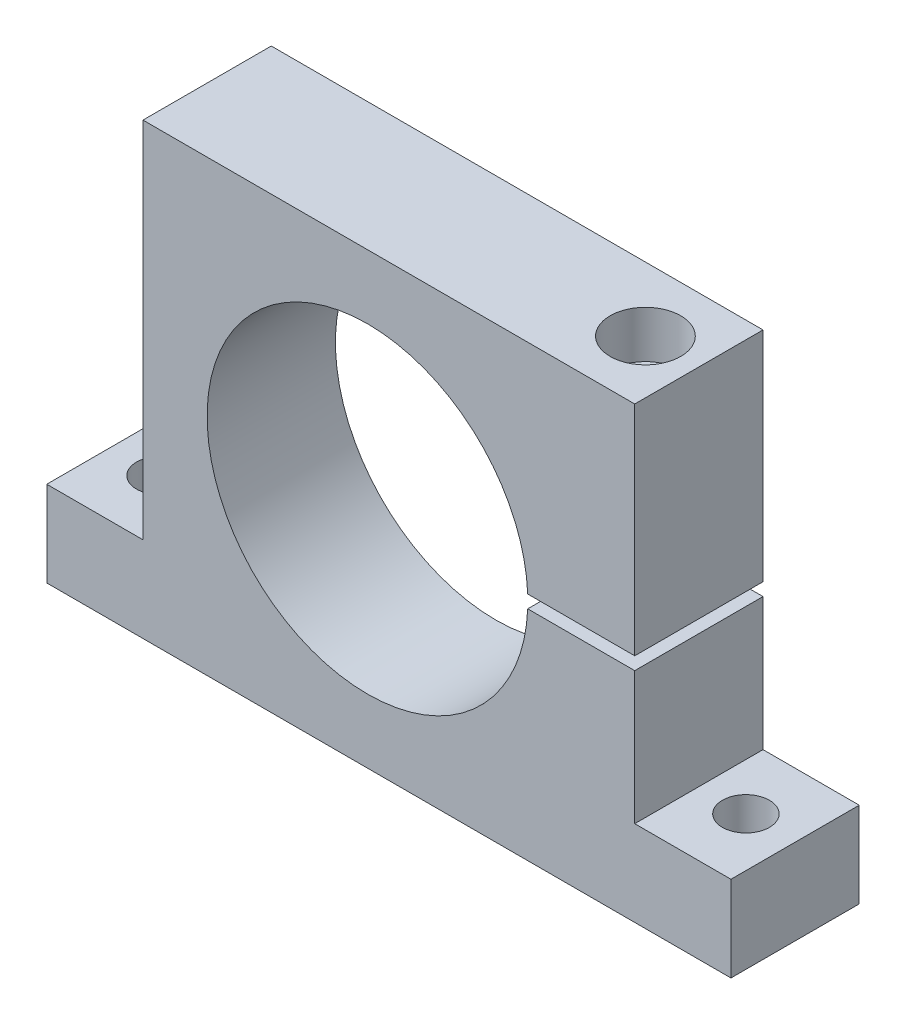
ISO-10303-21;
HEADER;
FILE_DESCRIPTION(('STEP AP214'),'2;1');
FILE_NAME('part.step','',(''),(''),'','','');
FILE_SCHEMA(('AUTOMOTIVE_DESIGN { 1 0 10303 214 1 1 1 1 }'));
ENDSEC;
DATA;
#1=APPLICATION_CONTEXT('core data for automotive mechanical design processes');
#2=APPLICATION_PROTOCOL_DEFINITION('international standard','automotive_design',2000,#1);
#3=PRODUCT_CONTEXT('',#1,'mechanical');
#4=PRODUCT('Part','Part','',(#3));
#5=PRODUCT_RELATED_PRODUCT_CATEGORY('part','',(#4));
#6=PRODUCT_DEFINITION_FORMATION('','',#4);
#7=PRODUCT_DEFINITION_CONTEXT('part definition',#1,'design');
#8=PRODUCT_DEFINITION('design','',#6,#7);
#9=PRODUCT_DEFINITION_SHAPE('','',#8);
#10=(LENGTH_UNIT() NAMED_UNIT(*) SI_UNIT(.MILLI.,.METRE.));
#11=(NAMED_UNIT(*) PLANE_ANGLE_UNIT() SI_UNIT($,.RADIAN.));
#12=(NAMED_UNIT(*) SI_UNIT($,.STERADIAN.) SOLID_ANGLE_UNIT());
#13=UNCERTAINTY_MEASURE_WITH_UNIT(LENGTH_MEASURE(1.E-05),#10,'distance_accuracy_value','');
#14=(GEOMETRIC_REPRESENTATION_CONTEXT(3) GLOBAL_UNCERTAINTY_ASSIGNED_CONTEXT((#13)) GLOBAL_UNIT_ASSIGNED_CONTEXT((#10,
#11,#12)) REPRESENTATION_CONTEXT('',''));
#15=CARTESIAN_POINT('',(0.,0.,0.));
#16=DIRECTION('',(0.,0.,1.));
#17=DIRECTION('',(1.,0.,0.));
#18=AXIS2_PLACEMENT_3D('',#15,#16,#17);
#19=CARTESIAN_POINT('',(62.5,1.49999999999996,15.));
#20=DIRECTION('',(0.,1.,0.));
#21=DIRECTION('',(-1.,0.,0.));
#22=AXIS2_PLACEMENT_3D('',#19,#20,#21);
#23=PLANE('',#22);
#24=DIRECTION('',(1.,0.,0.));
#25=VECTOR('',#24,1.);
#26=CARTESIAN_POINT('',(62.5,1.49999999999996,-15.));
#27=LINE('',#26,#25);
#28=CARTESIAN_POINT('',(37.4699879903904,1.49999999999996,-15.));
#29=VERTEX_POINT('',#28);
#30=CARTESIAN_POINT('',(62.5,1.49999999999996,-15.));
#31=VERTEX_POINT('',#30);
#32=EDGE_CURVE('E163',#29,#31,#27,.T.);
#33=ORIENTED_EDGE('',*,*,#32,.T.);
#34=DIRECTION('',(0.,0.,-1.));
#35=VECTOR('',#34,1.);
#36=CARTESIAN_POINT('',(62.5,1.49999999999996,15.));
#37=LINE('',#36,#35);
#38=CARTESIAN_POINT('',(62.5,1.49999999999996,15.));
#39=VERTEX_POINT('',#38);
#40=EDGE_CURVE('E46',#39,#31,#37,.T.);
#41=ORIENTED_EDGE('',*,*,#40,.F.);
#42=DIRECTION('',(1.,0.,0.));
#43=VECTOR('',#42,1.);
#44=CARTESIAN_POINT('',(62.5,1.49999999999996,15.));
#45=LINE('',#44,#43);
#46=CARTESIAN_POINT('',(37.4699879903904,1.49999999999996,15.));
#47=VERTEX_POINT('',#46);
#48=EDGE_CURVE('E110',#47,#39,#45,.T.);
#49=ORIENTED_EDGE('',*,*,#48,.F.);
#50=DIRECTION('',(0.,0.,-1.));
#51=VECTOR('',#50,1.);
#52=CARTESIAN_POINT('',(37.4699879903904,1.49999999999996,15.));
#53=LINE('',#52,#51);
#54=EDGE_CURVE('E11',#47,#29,#53,.T.);
#55=ORIENTED_EDGE('',*,*,#54,.T.);
#56=EDGE_LOOP('',(#33,#41,#49,#55));
#57=FACE_BOUND('',#56,.T.);
#58=CARTESIAN_POINT('',(50.,1.49999999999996,0.));
#59=DIRECTION('',(0.,1.,0.));
#60=DIRECTION('',(-1.,0.,0.));
#61=AXIS2_PLACEMENT_3D('',#58,#59,#60);
#62=CIRCLE('',#61,5.);
#63=CARTESIAN_POINT('',(45.,1.49999999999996,0.));
#64=VERTEX_POINT('',#63);
#65=EDGE_CURVE('E259',#64,#64,#62,.F.);
#66=ORIENTED_EDGE('',*,*,#65,.F.);
#67=EDGE_LOOP('',(#66));
#68=FACE_BOUND('',#67,.T.);
#69=ADVANCED_FACE('F36',(#57,#68),#23,.F.);
#70=CARTESIAN_POINT('',(-52.5,52.5,15.));
#71=DIRECTION('',(0.,-1.,0.));
#72=DIRECTION('',(0.,0.,-1.));
#73=AXIS2_PLACEMENT_3D('',#70,#71,#72);
#74=PLANE('',#73);
#75=DIRECTION('',(-1.,0.,0.));
#76=VECTOR('',#75,1.);
#77=CARTESIAN_POINT('',(-52.5,52.5,-15.));
#78=LINE('',#77,#76);
#79=CARTESIAN_POINT('',(62.5,52.5,-15.));
#80=VERTEX_POINT('',#79);
#81=CARTESIAN_POINT('',(-52.5,52.5,-15.));
#82=VERTEX_POINT('',#81);
#83=EDGE_CURVE('E168',#80,#82,#78,.T.);
#84=ORIENTED_EDGE('',*,*,#83,.T.);
#85=DIRECTION('',(0.,0.,-1.));
#86=VECTOR('',#85,1.);
#87=CARTESIAN_POINT('',(-52.5,52.5,15.));
#88=LINE('',#87,#86);
#89=CARTESIAN_POINT('',(-52.5,52.5,15.));
#90=VERTEX_POINT('',#89);
#91=EDGE_CURVE('E199',#90,#82,#88,.T.);
#92=ORIENTED_EDGE('',*,*,#91,.F.);
#93=DIRECTION('',(-1.,0.,0.));
#94=VECTOR('',#93,1.);
#95=CARTESIAN_POINT('',(-52.5,52.5,15.));
#96=LINE('',#95,#94);
#97=CARTESIAN_POINT('',(62.5,52.5,15.));
#98=VERTEX_POINT('',#97);
#99=EDGE_CURVE('E230',#98,#90,#96,.T.);
#100=ORIENTED_EDGE('',*,*,#99,.F.);
#101=DIRECTION('',(0.,0.,-1.));
#102=VECTOR('',#101,1.);
#103=CARTESIAN_POINT('',(62.5,52.5,15.));
#104=LINE('',#103,#102);
#105=EDGE_CURVE('E202',#98,#80,#104,.T.);
#106=ORIENTED_EDGE('',*,*,#105,.T.);
#107=EDGE_LOOP('',(#84,#92,#100,#106));
#108=FACE_BOUND('',#107,.T.);
#109=CARTESIAN_POINT('',(50.,52.5,0.));
#110=DIRECTION('',(0.,1.,0.));
#111=DIRECTION('',(0.,0.,1.));
#112=AXIS2_PLACEMENT_3D('',#109,#110,#111);
#113=CIRCLE('',#112,8.25);
#114=CARTESIAN_POINT('',(50.,52.5,8.25));
#115=VERTEX_POINT('',#114);
#116=EDGE_CURVE('E260',#115,#115,#113,.T.);
#117=ORIENTED_EDGE('',*,*,#116,.F.);
#118=EDGE_LOOP('',(#117));
#119=FACE_BOUND('',#118,.T.);
#120=ADVANCED_FACE('F220',(#108,#119),#74,.F.);
#121=CARTESIAN_POINT('',(62.5,-1.50000000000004,15.));
#122=DIRECTION('',(0.,-1.,0.));
#123=DIRECTION('',(1.,0.,0.));
#124=AXIS2_PLACEMENT_3D('',#121,#122,#123);
#125=PLANE('',#124);
#126=DIRECTION('',(-1.,0.,0.));
#127=VECTOR('',#126,1.);
#128=CARTESIAN_POINT('',(62.5,-1.50000000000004,-15.));
#129=LINE('',#128,#127);
#130=CARTESIAN_POINT('',(62.5,-1.50000000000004,-15.));
#131=VERTEX_POINT('',#130);
#132=CARTESIAN_POINT('',(37.4699879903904,-1.50000000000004,-15.));
#133=VERTEX_POINT('',#132);
#134=EDGE_CURVE('E102',#131,#133,#129,.T.);
#135=ORIENTED_EDGE('',*,*,#134,.T.);
#136=DIRECTION('',(0.,0.,-1.));
#137=VECTOR('',#136,1.);
#138=CARTESIAN_POINT('',(37.4699879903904,-1.50000000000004,15.));
#139=LINE('',#138,#137);
#140=CARTESIAN_POINT('',(37.4699879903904,-1.50000000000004,15.));
#141=VERTEX_POINT('',#140);
#142=EDGE_CURVE('E156',#141,#133,#139,.T.);
#143=ORIENTED_EDGE('',*,*,#142,.F.);
#144=DIRECTION('',(-1.,0.,0.));
#145=VECTOR('',#144,1.);
#146=CARTESIAN_POINT('',(62.5,-1.50000000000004,15.));
#147=LINE('',#146,#145);
#148=CARTESIAN_POINT('',(62.5,-1.50000000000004,15.));
#149=VERTEX_POINT('',#148);
#150=EDGE_CURVE('E54',#149,#141,#147,.T.);
#151=ORIENTED_EDGE('',*,*,#150,.F.);
#152=DIRECTION('',(0.,0.,-1.));
#153=VECTOR('',#152,1.);
#154=CARTESIAN_POINT('',(62.5,-1.50000000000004,15.));
#155=LINE('',#154,#153);
#156=EDGE_CURVE('E152',#149,#131,#155,.T.);
#157=ORIENTED_EDGE('',*,*,#156,.T.);
#158=EDGE_LOOP('',(#135,#143,#151,#157));
#159=FACE_BOUND('',#158,.T.);
#160=CARTESIAN_POINT('',(50.,-1.50000000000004,0.));
#161=DIRECTION('',(0.,-1.,0.));
#162=DIRECTION('',(1.,0.,0.));
#163=AXIS2_PLACEMENT_3D('',#160,#161,#162);
#164=CIRCLE('',#163,5.);
#165=CARTESIAN_POINT('',(55.,-1.50000000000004,0.));
#166=VERTEX_POINT('',#165);
#167=EDGE_CURVE('E40',#166,#166,#164,.F.);
#168=ORIENTED_EDGE('',*,*,#167,.F.);
#169=EDGE_LOOP('',(#168));
#170=FACE_BOUND('',#169,.T.);
#171=ADVANCED_FACE('F252',(#159,#170),#125,.F.);
#172=CARTESIAN_POINT('',(0.,0.,15.));
#173=DIRECTION('',(0.,0.,-1.));
#174=DIRECTION('',(-1.,0.,0.));
#175=AXIS2_PLACEMENT_3D('',#172,#173,#174);
#176=CYLINDRICAL_SURFACE('',#175,37.5);
#177=CARTESIAN_POINT('',(0.,0.,-15.));
#178=DIRECTION('',(0.,0.,-1.));
#179=DIRECTION('',(1.,0.,0.));
#180=AXIS2_PLACEMENT_3D('',#177,#178,#179);
#181=CIRCLE('',#180,37.5);
#182=EDGE_CURVE('E160',#133,#29,#181,.T.);
#183=ORIENTED_EDGE('',*,*,#182,.T.);
#184=ORIENTED_EDGE('',*,*,#54,.F.);
#185=CARTESIAN_POINT('',(0.,0.,15.));
#186=DIRECTION('',(0.,0.,-1.));
#187=DIRECTION('',(1.,0.,0.));
#188=AXIS2_PLACEMENT_3D('',#185,#186,#187);
#189=CIRCLE('',#188,37.5);
#190=EDGE_CURVE('E183',#141,#47,#189,.T.);
#191=ORIENTED_EDGE('',*,*,#190,.F.);
#192=ORIENTED_EDGE('',*,*,#142,.T.);
#193=EDGE_LOOP('',(#183,#184,#191,#192));
#194=FACE_BOUND('',#193,.T.);
#195=ADVANCED_FACE('F38',(#194),#176,.F.);
#196=CARTESIAN_POINT('',(62.5,52.5,15.));
#197=DIRECTION('',(-1.,0.,0.));
#198=DIRECTION('',(0.,0.,1.));
#199=AXIS2_PLACEMENT_3D('',#196,#197,#198);
#200=PLANE('',#199);
#201=DIRECTION('',(0.,1.,0.));
#202=VECTOR('',#201,1.);
#203=CARTESIAN_POINT('',(62.5,52.5,-15.));
#204=LINE('',#203,#202);
#205=EDGE_CURVE('E166',#31,#80,#204,.T.);
#206=ORIENTED_EDGE('',*,*,#205,.T.);
#207=ORIENTED_EDGE('',*,*,#105,.F.);
#208=DIRECTION('',(0.,1.,0.));
#209=VECTOR('',#208,1.);
#210=CARTESIAN_POINT('',(62.5,52.5,15.));
#211=LINE('',#210,#209);
#212=EDGE_CURVE('E211',#39,#98,#211,.T.);
#213=ORIENTED_EDGE('',*,*,#212,.F.);
#214=ORIENTED_EDGE('',*,*,#40,.T.);
#215=EDGE_LOOP('',(#206,#207,#213,#214));
#216=FACE_BOUND('',#215,.T.);
#217=ADVANCED_FACE('F209',(#216),#200,.F.);
#218=CARTESIAN_POINT('',(-52.5,-32.5,15.));
#219=DIRECTION('',(1.,0.,0.));
#220=DIRECTION('',(0.,0.,-1.));
#221=AXIS2_PLACEMENT_3D('',#218,#219,#220);
#222=PLANE('',#221);
#223=DIRECTION('',(0.,-1.,0.));
#224=VECTOR('',#223,1.);
#225=CARTESIAN_POINT('',(-52.5,-32.5,-15.));
#226=LINE('',#225,#224);
#227=CARTESIAN_POINT('',(-52.5,-32.5,-15.));
#228=VERTEX_POINT('',#227);
#229=EDGE_CURVE('E170',#82,#228,#226,.T.);
#230=ORIENTED_EDGE('',*,*,#229,.T.);
#231=DIRECTION('',(0.,0.,-1.));
#232=VECTOR('',#231,1.);
#233=CARTESIAN_POINT('',(-52.5,-32.5,15.));
#234=LINE('',#233,#232);
#235=CARTESIAN_POINT('',(-52.5,-32.5,15.));
#236=VERTEX_POINT('',#235);
#237=EDGE_CURVE('E196',#236,#228,#234,.T.);
#238=ORIENTED_EDGE('',*,*,#237,.F.);
#239=DIRECTION('',(0.,-1.,0.));
#240=VECTOR('',#239,1.);
#241=CARTESIAN_POINT('',(-52.5,-32.5,15.));
#242=LINE('',#241,#240);
#243=EDGE_CURVE('E227',#90,#236,#242,.T.);
#244=ORIENTED_EDGE('',*,*,#243,.F.);
#245=ORIENTED_EDGE('',*,*,#91,.T.);
#246=EDGE_LOOP('',(#230,#238,#244,#245));
#247=FACE_BOUND('',#246,.T.);
#248=ADVANCED_FACE('F225',(#247),#222,.F.);
#249=CARTESIAN_POINT('',(-75.,-32.5,15.));
#250=DIRECTION('',(0.,-1.,0.));
#251=DIRECTION('',(0.,0.,-1.));
#252=AXIS2_PLACEMENT_3D('',#249,#250,#251);
#253=PLANE('',#252);
#254=CARTESIAN_POINT('',(-63.5,-32.5,0.));
#255=DIRECTION('',(0.,-1.,0.));
#256=DIRECTION('',(1.,0.,0.));
#257=AXIS2_PLACEMENT_3D('',#254,#255,#256);
#258=CIRCLE('',#257,5.5);
#259=CARTESIAN_POINT('',(-58.,-32.5,0.));
#260=VERTEX_POINT('',#259);
#261=EDGE_CURVE('E164',#260,#260,#258,.T.);
#262=ORIENTED_EDGE('',*,*,#261,.T.);
#263=EDGE_LOOP('',(#262));
#264=FACE_BOUND('',#263,.T.);
#265=DIRECTION('',(-1.,0.,0.));
#266=VECTOR('',#265,1.);
#267=CARTESIAN_POINT('',(-75.,-32.5,-15.));
#268=LINE('',#267,#266);
#269=CARTESIAN_POINT('',(-75.,-32.5,-15.));
#270=VERTEX_POINT('',#269);
#271=EDGE_CURVE('E172',#228,#270,#268,.T.);
#272=ORIENTED_EDGE('',*,*,#271,.T.);
#273=DIRECTION('',(0.,0.,-1.));
#274=VECTOR('',#273,1.);
#275=CARTESIAN_POINT('',(-75.,-32.5,15.));
#276=LINE('',#275,#274);
#277=CARTESIAN_POINT('',(-75.,-32.5,15.));
#278=VERTEX_POINT('',#277);
#279=EDGE_CURVE('E193',#278,#270,#276,.T.);
#280=ORIENTED_EDGE('',*,*,#279,.F.);
#281=DIRECTION('',(-1.,0.,0.));
#282=VECTOR('',#281,1.);
#283=CARTESIAN_POINT('',(-75.,-32.5,15.));
#284=LINE('',#283,#282);
#285=EDGE_CURVE('E229',#236,#278,#284,.T.);
#286=ORIENTED_EDGE('',*,*,#285,.F.);
#287=ORIENTED_EDGE('',*,*,#237,.T.);
#288=EDGE_LOOP('',(#272,#280,#286,#287));
#289=FACE_BOUND('',#288,.T.);
#290=ADVANCED_FACE('F298',(#264,#289),#253,.F.);
#291=CARTESIAN_POINT('',(-75.,-52.5,15.));
#292=DIRECTION('',(1.,0.,0.));
#293=DIRECTION('',(0.,0.,-1.));
#294=AXIS2_PLACEMENT_3D('',#291,#292,#293);
#295=PLANE('',#294);
#296=DIRECTION('',(0.,-1.,0.));
#297=VECTOR('',#296,1.);
#298=CARTESIAN_POINT('',(-75.,-52.5,-15.));
#299=LINE('',#298,#297);
#300=CARTESIAN_POINT('',(-75.,-52.5,-15.));
#301=VERTEX_POINT('',#300);
#302=EDGE_CURVE('E174',#270,#301,#299,.T.);
#303=ORIENTED_EDGE('',*,*,#302,.T.);
#304=DIRECTION('',(0.,0.,-1.));
#305=VECTOR('',#304,1.);
#306=CARTESIAN_POINT('',(-75.,-52.5,15.));
#307=LINE('',#306,#305);
#308=CARTESIAN_POINT('',(-75.,-52.5,15.));
#309=VERTEX_POINT('',#308);
#310=EDGE_CURVE('E190',#309,#301,#307,.T.);
#311=ORIENTED_EDGE('',*,*,#310,.F.);
#312=DIRECTION('',(0.,-1.,0.));
#313=VECTOR('',#312,1.);
#314=CARTESIAN_POINT('',(-75.,-52.5,15.));
#315=LINE('',#314,#313);
#316=EDGE_CURVE('E232',#278,#309,#315,.T.);
#317=ORIENTED_EDGE('',*,*,#316,.F.);
#318=ORIENTED_EDGE('',*,*,#279,.T.);
#319=EDGE_LOOP('',(#303,#311,#317,#318));
#320=FACE_BOUND('',#319,.T.);
#321=ADVANCED_FACE('F290',(#320),#295,.F.);
#322=CARTESIAN_POINT('',(85.,-52.5,15.));
#323=DIRECTION('',(0.,1.,0.));
#324=DIRECTION('',(0.,0.,1.));
#325=AXIS2_PLACEMENT_3D('',#322,#323,#324);
#326=PLANE('',#325);
#327=CARTESIAN_POINT('',(73.5,-52.5,0.));
#328=DIRECTION('',(0.,-1.,0.));
#329=DIRECTION('',(1.,0.,0.));
#330=AXIS2_PLACEMENT_3D('',#327,#328,#329);
#331=CIRCLE('',#330,5.5);
#332=CARTESIAN_POINT('',(79.,-52.5,0.));
#333=VERTEX_POINT('',#332);
#334=EDGE_CURVE('E262',#333,#333,#331,.T.);
#335=ORIENTED_EDGE('',*,*,#334,.F.);
#336=EDGE_LOOP('',(#335));
#337=FACE_BOUND('',#336,.T.);
#338=CARTESIAN_POINT('',(-63.5,-52.5,0.));
#339=DIRECTION('',(0.,-1.,0.));
#340=DIRECTION('',(1.,0.,0.));
#341=AXIS2_PLACEMENT_3D('',#338,#339,#340);
#342=CIRCLE('',#341,5.5);
#343=CARTESIAN_POINT('',(-58.,-52.5,0.));
#344=VERTEX_POINT('',#343);
#345=EDGE_CURVE('E277',#344,#344,#342,.T.);
#346=ORIENTED_EDGE('',*,*,#345,.F.);
#347=EDGE_LOOP('',(#346));
#348=FACE_BOUND('',#347,.T.);
#349=DIRECTION('',(1.,0.,0.));
#350=VECTOR('',#349,1.);
#351=CARTESIAN_POINT('',(85.,-52.5,-15.));
#352=LINE('',#351,#350);
#353=CARTESIAN_POINT('',(85.,-52.5,-15.));
#354=VERTEX_POINT('',#353);
#355=EDGE_CURVE('E176',#301,#354,#352,.T.);
#356=ORIENTED_EDGE('',*,*,#355,.T.);
#357=DIRECTION('',(0.,0.,-1.));
#358=VECTOR('',#357,1.);
#359=CARTESIAN_POINT('',(85.,-52.5,15.));
#360=LINE('',#359,#358);
#361=CARTESIAN_POINT('',(85.,-52.5,15.));
#362=VERTEX_POINT('',#361);
#363=EDGE_CURVE('E187',#362,#354,#360,.T.);
#364=ORIENTED_EDGE('',*,*,#363,.F.);
#365=DIRECTION('',(1.,0.,0.));
#366=VECTOR('',#365,1.);
#367=CARTESIAN_POINT('',(85.,-52.5,15.));
#368=LINE('',#367,#366);
#369=EDGE_CURVE('E238',#309,#362,#368,.T.);
#370=ORIENTED_EDGE('',*,*,#369,.F.);
#371=ORIENTED_EDGE('',*,*,#310,.T.);
#372=EDGE_LOOP('',(#356,#364,#370,#371));
#373=FACE_BOUND('',#372,.T.);
#374=ADVANCED_FACE('F244',(#337,#348,#373),#326,.F.);
#375=CARTESIAN_POINT('',(85.,-32.5,15.));
#376=DIRECTION('',(-1.,0.,0.));
#377=DIRECTION('',(0.,0.,1.));
#378=AXIS2_PLACEMENT_3D('',#375,#376,#377);
#379=PLANE('',#378);
#380=DIRECTION('',(0.,1.,0.));
#381=VECTOR('',#380,1.);
#382=CARTESIAN_POINT('',(85.,-32.5,-15.));
#383=LINE('',#382,#381);
#384=CARTESIAN_POINT('',(85.,-32.5,-15.));
#385=VERTEX_POINT('',#384);
#386=EDGE_CURVE('E178',#354,#385,#383,.T.);
#387=ORIENTED_EDGE('',*,*,#386,.T.);
#388=DIRECTION('',(0.,0.,-1.));
#389=VECTOR('',#388,1.);
#390=CARTESIAN_POINT('',(85.,-32.5,15.));
#391=LINE('',#390,#389);
#392=CARTESIAN_POINT('',(85.,-32.5,15.));
#393=VERTEX_POINT('',#392);
#394=EDGE_CURVE('E151',#393,#385,#391,.T.);
#395=ORIENTED_EDGE('',*,*,#394,.F.);
#396=DIRECTION('',(0.,1.,0.));
#397=VECTOR('',#396,1.);
#398=CARTESIAN_POINT('',(85.,-32.5,15.));
#399=LINE('',#398,#397);
#400=EDGE_CURVE('E142',#362,#393,#399,.T.);
#401=ORIENTED_EDGE('',*,*,#400,.F.);
#402=ORIENTED_EDGE('',*,*,#363,.T.);
#403=EDGE_LOOP('',(#387,#395,#401,#402));
#404=FACE_BOUND('',#403,.T.);
#405=ADVANCED_FACE('F248',(#404),#379,.F.);
#406=CARTESIAN_POINT('',(62.5,-32.5,15.));
#407=DIRECTION('',(0.,-1.,0.));
#408=DIRECTION('',(0.,0.,-1.));
#409=AXIS2_PLACEMENT_3D('',#406,#407,#408);
#410=PLANE('',#409);
#411=CARTESIAN_POINT('',(73.5,-32.5,0.));
#412=DIRECTION('',(0.,-1.,0.));
#413=DIRECTION('',(1.,0.,0.));
#414=AXIS2_PLACEMENT_3D('',#411,#412,#413);
#415=CIRCLE('',#414,5.5);
#416=CARTESIAN_POINT('',(79.,-32.5,0.));
#417=VERTEX_POINT('',#416);
#418=EDGE_CURVE('E274',#417,#417,#415,.T.);
#419=ORIENTED_EDGE('',*,*,#418,.T.);
#420=EDGE_LOOP('',(#419));
#421=FACE_BOUND('',#420,.T.);
#422=DIRECTION('',(-1.,0.,0.));
#423=VECTOR('',#422,1.);
#424=CARTESIAN_POINT('',(62.5,-32.5,-15.));
#425=LINE('',#424,#423);
#426=CARTESIAN_POINT('',(62.5,-32.5,-15.));
#427=VERTEX_POINT('',#426);
#428=EDGE_CURVE('E150',#385,#427,#425,.T.);
#429=ORIENTED_EDGE('',*,*,#428,.T.);
#430=DIRECTION('',(0.,0.,-1.));
#431=VECTOR('',#430,1.);
#432=CARTESIAN_POINT('',(62.5,-32.5,15.));
#433=LINE('',#432,#431);
#434=CARTESIAN_POINT('',(62.5,-32.5,15.));
#435=VERTEX_POINT('',#434);
#436=EDGE_CURVE('E147',#435,#427,#433,.T.);
#437=ORIENTED_EDGE('',*,*,#436,.F.);
#438=DIRECTION('',(-1.,0.,0.));
#439=VECTOR('',#438,1.);
#440=CARTESIAN_POINT('',(62.5,-32.5,15.));
#441=LINE('',#440,#439);
#442=EDGE_CURVE('E136',#393,#435,#441,.T.);
#443=ORIENTED_EDGE('',*,*,#442,.F.);
#444=ORIENTED_EDGE('',*,*,#394,.T.);
#445=EDGE_LOOP('',(#429,#437,#443,#444));
#446=FACE_BOUND('',#445,.T.);
#447=ADVANCED_FACE('F148',(#421,#446),#410,.F.);
#448=CARTESIAN_POINT('',(62.5,-1.50000000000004,15.));
#449=DIRECTION('',(-1.,0.,0.));
#450=DIRECTION('',(0.,0.,1.));
#451=AXIS2_PLACEMENT_3D('',#448,#449,#450);
#452=PLANE('',#451);
#453=DIRECTION('',(0.,1.,0.));
#454=VECTOR('',#453,1.);
#455=CARTESIAN_POINT('',(62.5,-1.50000000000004,-15.));
#456=LINE('',#455,#454);
#457=EDGE_CURVE('E96',#427,#131,#456,.T.);
#458=ORIENTED_EDGE('',*,*,#457,.T.);
#459=ORIENTED_EDGE('',*,*,#156,.F.);
#460=DIRECTION('',(0.,1.,0.));
#461=VECTOR('',#460,1.);
#462=CARTESIAN_POINT('',(62.5,-1.50000000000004,15.));
#463=LINE('',#462,#461);
#464=EDGE_CURVE('E140',#435,#149,#463,.T.);
#465=ORIENTED_EDGE('',*,*,#464,.F.);
#466=ORIENTED_EDGE('',*,*,#436,.T.);
#467=EDGE_LOOP('',(#458,#459,#465,#466));
#468=FACE_BOUND('',#467,.T.);
#469=ADVANCED_FACE('F154',(#468),#452,.F.);
#470=CARTESIAN_POINT('',(0.,0.,15.));
#471=DIRECTION('',(0.,0.,1.));
#472=DIRECTION('',(1.,0.,0.));
#473=AXIS2_PLACEMENT_3D('',#470,#471,#472);
#474=PLANE('',#473);
#475=ORIENTED_EDGE('',*,*,#190,.T.);
#476=ORIENTED_EDGE('',*,*,#48,.T.);
#477=ORIENTED_EDGE('',*,*,#212,.T.);
#478=ORIENTED_EDGE('',*,*,#99,.T.);
#479=ORIENTED_EDGE('',*,*,#243,.T.);
#480=ORIENTED_EDGE('',*,*,#285,.T.);
#481=ORIENTED_EDGE('',*,*,#316,.T.);
#482=ORIENTED_EDGE('',*,*,#369,.T.);
#483=ORIENTED_EDGE('',*,*,#400,.T.);
#484=ORIENTED_EDGE('',*,*,#442,.T.);
#485=ORIENTED_EDGE('',*,*,#464,.T.);
#486=ORIENTED_EDGE('',*,*,#150,.T.);
#487=EDGE_LOOP('',(#475,#476,#477,#478,#479,#480,#481,#482,#483,#484,#485,#486));
#488=FACE_BOUND('',#487,.T.);
#489=ADVANCED_FACE('F138',(#488),#474,.T.);
#490=CARTESIAN_POINT('',(0.,0.,-15.));
#491=DIRECTION('',(0.,0.,1.));
#492=DIRECTION('',(1.,0.,0.));
#493=AXIS2_PLACEMENT_3D('',#490,#491,#492);
#494=PLANE('',#493);
#495=ORIENTED_EDGE('',*,*,#182,.F.);
#496=ORIENTED_EDGE('',*,*,#134,.F.);
#497=ORIENTED_EDGE('',*,*,#457,.F.);
#498=ORIENTED_EDGE('',*,*,#428,.F.);
#499=ORIENTED_EDGE('',*,*,#386,.F.);
#500=ORIENTED_EDGE('',*,*,#355,.F.);
#501=ORIENTED_EDGE('',*,*,#302,.F.);
#502=ORIENTED_EDGE('',*,*,#271,.F.);
#503=ORIENTED_EDGE('',*,*,#229,.F.);
#504=ORIENTED_EDGE('',*,*,#83,.F.);
#505=ORIENTED_EDGE('',*,*,#205,.F.);
#506=ORIENTED_EDGE('',*,*,#32,.F.);
#507=EDGE_LOOP('',(#495,#496,#497,#498,#499,#500,#501,#502,#503,#504,#505,#506));
#508=FACE_BOUND('',#507,.T.);
#509=ADVANCED_FACE('F215',(#508),#494,.F.);
#510=CARTESIAN_POINT('',(-63.5,-32.5,0.));
#511=DIRECTION('',(0.,-1.,0.));
#512=DIRECTION('',(1.,0.,0.));
#513=AXIS2_PLACEMENT_3D('',#510,#511,#512);
#514=CYLINDRICAL_SURFACE('',#513,5.5);
#515=ORIENTED_EDGE('',*,*,#261,.F.);
#516=EDGE_LOOP('',(#515));
#517=FACE_BOUND('',#516,.T.);
#518=ORIENTED_EDGE('',*,*,#345,.T.);
#519=EDGE_LOOP('',(#518));
#520=FACE_BOUND('',#519,.T.);
#521=ADVANCED_FACE('F287',(#517,#520),#514,.F.);
#522=CARTESIAN_POINT('',(73.5,-32.5,0.));
#523=DIRECTION('',(0.,-1.,0.));
#524=DIRECTION('',(1.,0.,0.));
#525=AXIS2_PLACEMENT_3D('',#522,#523,#524);
#526=CYLINDRICAL_SURFACE('',#525,5.5);
#527=ORIENTED_EDGE('',*,*,#418,.F.);
#528=EDGE_LOOP('',(#527));
#529=FACE_BOUND('',#528,.T.);
#530=ORIENTED_EDGE('',*,*,#334,.T.);
#531=EDGE_LOOP('',(#530));
#532=FACE_BOUND('',#531,.T.);
#533=ADVANCED_FACE('F323',(#529,#532),#526,.F.);
#534=CARTESIAN_POINT('',(50.,-40.5043030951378,0.));
#535=DIRECTION('',(0.,1.,0.));
#536=DIRECTION('',(0.,0.,1.));
#537=AXIS2_PLACEMENT_3D('',#534,#535,#536);
#538=CONICAL_SURFACE('',#537,0.,1.02974425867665);
#539=CARTESIAN_POINT('',(50.,-37.5,0.));
#540=DIRECTION('',(0.,1.,0.));
#541=DIRECTION('',(0.,0.,1.));
#542=AXIS2_PLACEMENT_3D('',#539,#540,#541);
#543=CIRCLE('',#542,5.);
#544=CARTESIAN_POINT('',(50.,-37.5,5.));
#545=VERTEX_POINT('',#544);
#546=EDGE_CURVE('E480',#545,#545,#543,.T.);
#547=ORIENTED_EDGE('',*,*,#546,.T.);
#548=EDGE_LOOP('',(#547));
#549=FACE_BOUND('',#548,.T.);
#550=CARTESIAN_POINT('',(50.,-40.5043030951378,0.));
#551=VERTEX_POINT('',#550);
#552=VERTEX_LOOP('',#551);
#553=FACE_BOUND('',#552,.T.);
#554=ADVANCED_FACE('F329',(#549,#553),#538,.F.);
#555=CARTESIAN_POINT('',(50.,52.5,0.));
#556=DIRECTION('',(0.,1.,0.));
#557=DIRECTION('',(0.,0.,1.));
#558=AXIS2_PLACEMENT_3D('',#555,#556,#557);
#559=CYLINDRICAL_SURFACE('',#558,5.);
#560=ORIENTED_EDGE('',*,*,#546,.F.);
#561=EDGE_LOOP('',(#560));
#562=FACE_BOUND('',#561,.T.);
#563=ORIENTED_EDGE('',*,*,#167,.T.);
#564=EDGE_LOOP('',(#563));
#565=FACE_BOUND('',#564,.T.);
#566=ADVANCED_FACE('F435',(#562,#565),#559,.F.);
#567=CARTESIAN_POINT('',(50.,41.5,0.));
#568=DIRECTION('',(0.,1.,0.));
#569=DIRECTION('',(0.,0.,1.));
#570=AXIS2_PLACEMENT_3D('',#567,#568,#569);
#571=CIRCLE('',#570,5.);
#572=CARTESIAN_POINT('',(50.,41.5,5.));
#573=VERTEX_POINT('',#572);
#574=EDGE_CURVE('E270',#573,#573,#571,.T.);
#575=ORIENTED_EDGE('',*,*,#574,.T.);
#576=EDGE_LOOP('',(#575));
#577=FACE_BOUND('',#576,.T.);
#578=ORIENTED_EDGE('',*,*,#65,.T.);
#579=EDGE_LOOP('',(#578));
#580=FACE_BOUND('',#579,.T.);
#581=ADVANCED_FACE('F442',(#577,#580),#559,.F.);
#582=CARTESIAN_POINT('',(50.,52.5,0.));
#583=DIRECTION('',(0.,1.,0.));
#584=DIRECTION('',(0.,0.,1.));
#585=AXIS2_PLACEMENT_3D('',#582,#583,#584);
#586=CYLINDRICAL_SURFACE('',#585,8.25);
#587=ORIENTED_EDGE('',*,*,#116,.T.);
#588=EDGE_LOOP('',(#587));
#589=FACE_BOUND('',#588,.T.);
#590=CARTESIAN_POINT('',(50.,41.5,0.));
#591=DIRECTION('',(0.,1.,0.));
#592=DIRECTION('',(0.,0.,1.));
#593=AXIS2_PLACEMENT_3D('',#590,#591,#592);
#594=CIRCLE('',#593,8.24999999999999);
#595=CARTESIAN_POINT('',(50.,41.5,8.24999999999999));
#596=VERTEX_POINT('',#595);
#597=EDGE_CURVE('E265',#596,#596,#594,.T.);
#598=ORIENTED_EDGE('',*,*,#597,.F.);
#599=EDGE_LOOP('',(#598));
#600=FACE_BOUND('',#599,.T.);
#601=ADVANCED_FACE('F450',(#589,#600),#586,.F.);
#602=CARTESIAN_POINT('',(58.25,41.5,0.));
#603=DIRECTION('',(0.,1.,0.));
#604=DIRECTION('',(0.,0.,1.));
#605=AXIS2_PLACEMENT_3D('',#602,#603,#604);
#606=PLANE('',#605);
#607=ORIENTED_EDGE('',*,*,#597,.T.);
#608=EDGE_LOOP('',(#607));
#609=FACE_BOUND('',#608,.T.);
#610=ORIENTED_EDGE('',*,*,#574,.F.);
#611=EDGE_LOOP('',(#610));
#612=FACE_BOUND('',#611,.T.);
#613=ADVANCED_FACE('F457',(#609,#612),#606,.T.);
#614=CLOSED_SHELL('',(#69,#120,#171,#195,#217,#248,#290,#321,#374,#405,#447,#469,#489,#509,#521,
#533,#554,#566,#581,#601,#613));
#615=MANIFOLD_SOLID_BREP('B2',#614);
#616=ADVANCED_BREP_SHAPE_REPRESENTATION('',(#18,#615),#14);
#617=SHAPE_DEFINITION_REPRESENTATION(#9,#616);
ENDSEC;
END-ISO-10303-21;
